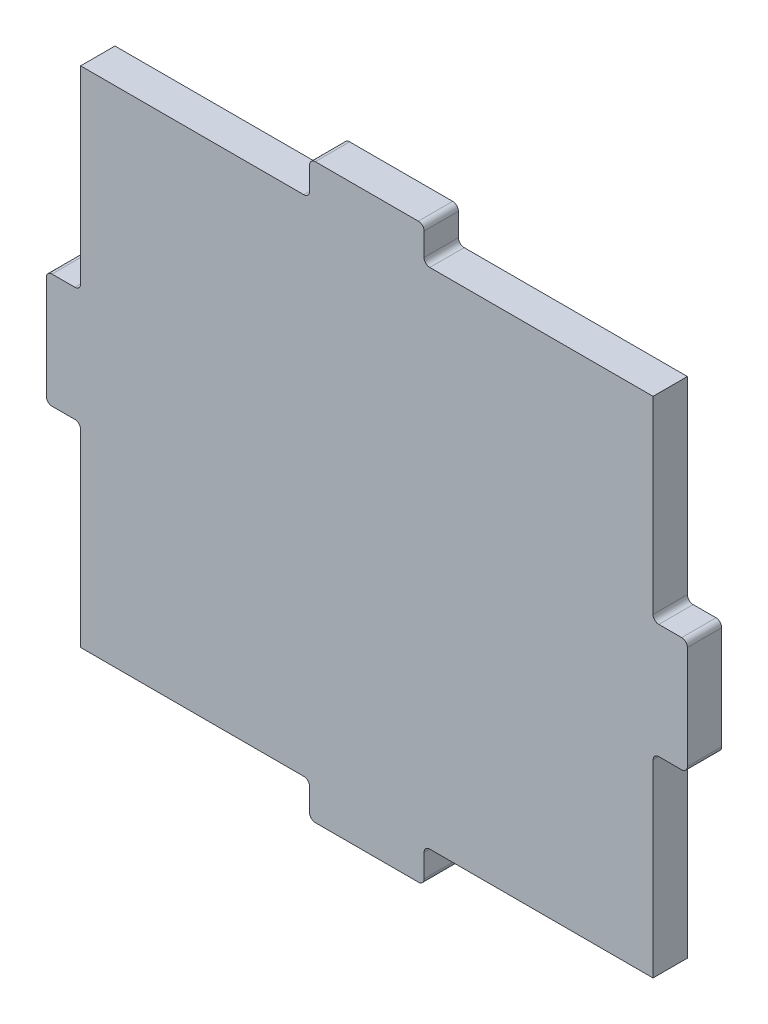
ISO-10303-21;
HEADER;
FILE_DESCRIPTION(('STEP AP214'),'2;1');
FILE_NAME('part.step','',(''),(''),'','','');
FILE_SCHEMA(('AUTOMOTIVE_DESIGN { 1 0 10303 214 1 1 1 1 }'));
ENDSEC;
DATA;
#1=APPLICATION_CONTEXT('core data for automotive mechanical design processes');
#2=APPLICATION_PROTOCOL_DEFINITION('international standard','automotive_design',2000,#1);
#3=PRODUCT_CONTEXT('',#1,'mechanical');
#4=PRODUCT('Part','Part','',(#3));
#5=PRODUCT_RELATED_PRODUCT_CATEGORY('part','',(#4));
#6=PRODUCT_DEFINITION_FORMATION('','',#4);
#7=PRODUCT_DEFINITION_CONTEXT('part definition',#1,'design');
#8=PRODUCT_DEFINITION('design','',#6,#7);
#9=PRODUCT_DEFINITION_SHAPE('','',#8);
#10=(LENGTH_UNIT() NAMED_UNIT(*) SI_UNIT(.MILLI.,.METRE.));
#11=(NAMED_UNIT(*) PLANE_ANGLE_UNIT() SI_UNIT($,.RADIAN.));
#12=(NAMED_UNIT(*) SI_UNIT($,.STERADIAN.) SOLID_ANGLE_UNIT());
#13=UNCERTAINTY_MEASURE_WITH_UNIT(LENGTH_MEASURE(1.E-05),#10,'distance_accuracy_value','');
#14=(GEOMETRIC_REPRESENTATION_CONTEXT(3) GLOBAL_UNCERTAINTY_ASSIGNED_CONTEXT((#13)) GLOBAL_UNIT_ASSIGNED_CONTEXT((#10,
#11,#12)) REPRESENTATION_CONTEXT('',''));
#15=CARTESIAN_POINT('',(0.,0.,0.));
#16=DIRECTION('',(0.,0.,1.));
#17=DIRECTION('',(1.,0.,0.));
#18=AXIS2_PLACEMENT_3D('',#15,#16,#17);
#19=CARTESIAN_POINT('',(50.,-10.,6.));
#20=DIRECTION('',(-1.,0.,0.));
#21=DIRECTION('',(0.,0.,1.));
#22=AXIS2_PLACEMENT_3D('',#19,#20,#21);
#23=PLANE('',#22);
#24=DIRECTION('',(0.,1.,0.));
#25=VECTOR('',#24,1.);
#26=CARTESIAN_POINT('',(50.,-10.,0.));
#27=LINE('',#26,#25);
#28=CARTESIAN_POINT('',(50.,-44.,0.));
#29=VERTEX_POINT('',#28);
#30=CARTESIAN_POINT('',(50.,-11.,0.));
#31=VERTEX_POINT('',#30);
#32=EDGE_CURVE('E366',#29,#31,#27,.T.);
#33=ORIENTED_EDGE('',*,*,#32,.T.);
#34=DIRECTION('',(0.,0.,-1.));
#35=VECTOR('',#34,1.);
#36=CARTESIAN_POINT('',(50.,-11.,6.));
#37=LINE('',#36,#35);
#38=CARTESIAN_POINT('',(50.,-11.,6.));
#39=VERTEX_POINT('',#38);
#40=EDGE_CURVE('E538',#31,#39,#37,.F.);
#41=ORIENTED_EDGE('',*,*,#40,.T.);
#42=DIRECTION('',(0.,1.,0.));
#43=VECTOR('',#42,1.);
#44=CARTESIAN_POINT('',(50.,-10.,6.));
#45=LINE('',#44,#43);
#46=CARTESIAN_POINT('',(50.,-44.,6.));
#47=VERTEX_POINT('',#46);
#48=EDGE_CURVE('E439',#47,#39,#45,.T.);
#49=ORIENTED_EDGE('',*,*,#48,.F.);
#50=DIRECTION('',(0.,0.,-1.));
#51=VECTOR('',#50,1.);
#52=CARTESIAN_POINT('',(50.,-44.,6.));
#53=LINE('',#52,#51);
#54=EDGE_CURVE('E365',#47,#29,#53,.T.);
#55=ORIENTED_EDGE('',*,*,#54,.T.);
#56=EDGE_LOOP('',(#33,#41,#49,#55));
#57=FACE_BOUND('',#56,.T.);
#58=ADVANCED_FACE('F45',(#57),#23,.F.);
#59=CARTESIAN_POINT('',(56.,-10.,6.));
#60=DIRECTION('',(0.,1.,0.));
#61=DIRECTION('',(-1.,0.,0.));
#62=AXIS2_PLACEMENT_3D('',#59,#60,#61);
#63=PLANE('',#62);
#64=DIRECTION('',(1.,0.,0.));
#65=VECTOR('',#64,1.);
#66=CARTESIAN_POINT('',(56.,-10.,0.));
#67=LINE('',#66,#65);
#68=CARTESIAN_POINT('',(51.,-10.,0.));
#69=VERTEX_POINT('',#68);
#70=CARTESIAN_POINT('',(55.,-10.,0.));
#71=VERTEX_POINT('',#70);
#72=EDGE_CURVE('E370',#69,#71,#67,.T.);
#73=ORIENTED_EDGE('',*,*,#72,.T.);
#74=DIRECTION('',(0.,0.,-1.));
#75=VECTOR('',#74,1.);
#76=CARTESIAN_POINT('',(55.,-10.,6.));
#77=LINE('',#76,#75);
#78=CARTESIAN_POINT('',(55.,-10.,6.));
#79=VERTEX_POINT('',#78);
#80=EDGE_CURVE('E535',#71,#79,#77,.F.);
#81=ORIENTED_EDGE('',*,*,#80,.T.);
#82=DIRECTION('',(1.,0.,0.));
#83=VECTOR('',#82,1.);
#84=CARTESIAN_POINT('',(56.,-10.,6.));
#85=LINE('',#84,#83);
#86=CARTESIAN_POINT('',(51.,-10.,6.));
#87=VERTEX_POINT('',#86);
#88=EDGE_CURVE('E746',#87,#79,#85,.T.);
#89=ORIENTED_EDGE('',*,*,#88,.F.);
#90=DIRECTION('',(0.,0.,-1.));
#91=VECTOR('',#90,1.);
#92=CARTESIAN_POINT('',(51.,-10.,0.));
#93=LINE('',#92,#91);
#94=EDGE_CURVE('E531',#87,#69,#93,.T.);
#95=ORIENTED_EDGE('',*,*,#94,.T.);
#96=EDGE_LOOP('',(#73,#81,#89,#95));
#97=FACE_BOUND('',#96,.T.);
#98=ADVANCED_FACE('F754',(#97),#63,.F.);
#99=CARTESIAN_POINT('',(56.,10.,6.));
#100=DIRECTION('',(-1.,0.,0.));
#101=DIRECTION('',(0.,-1.,0.));
#102=AXIS2_PLACEMENT_3D('',#99,#100,#101);
#103=PLANE('',#102);
#104=DIRECTION('',(0.,1.,0.));
#105=VECTOR('',#104,1.);
#106=CARTESIAN_POINT('',(56.,10.,6.));
#107=LINE('',#106,#105);
#108=CARTESIAN_POINT('',(56.,-9.00000000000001,6.));
#109=VERTEX_POINT('',#108);
#110=CARTESIAN_POINT('',(56.,9.,6.));
#111=VERTEX_POINT('',#110);
#112=EDGE_CURVE('E766',#109,#111,#107,.T.);
#113=ORIENTED_EDGE('',*,*,#112,.F.);
#114=DIRECTION('',(0.,0.,-1.));
#115=VECTOR('',#114,1.);
#116=CARTESIAN_POINT('',(56.,-9.00000000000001,6.));
#117=LINE('',#116,#115);
#118=CARTESIAN_POINT('',(56.,-9.00000000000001,0.));
#119=VERTEX_POINT('',#118);
#120=EDGE_CURVE('E527',#109,#119,#117,.T.);
#121=ORIENTED_EDGE('',*,*,#120,.T.);
#122=DIRECTION('',(0.,1.,0.));
#123=VECTOR('',#122,1.);
#124=CARTESIAN_POINT('',(56.,10.,0.));
#125=LINE('',#124,#123);
#126=CARTESIAN_POINT('',(56.,9.,0.));
#127=VERTEX_POINT('',#126);
#128=EDGE_CURVE('E374',#119,#127,#125,.T.);
#129=ORIENTED_EDGE('',*,*,#128,.T.);
#130=DIRECTION('',(0.,0.,-1.));
#131=VECTOR('',#130,1.);
#132=CARTESIAN_POINT('',(56.,9.,6.));
#133=LINE('',#132,#131);
#134=EDGE_CURVE('E524',#127,#111,#133,.F.);
#135=ORIENTED_EDGE('',*,*,#134,.T.);
#136=EDGE_LOOP('',(#113,#121,#129,#135));
#137=FACE_BOUND('',#136,.T.);
#138=ADVANCED_FACE('F763',(#137),#103,.F.);
#139=CARTESIAN_POINT('',(50.,10.,6.));
#140=DIRECTION('',(0.,-1.,0.));
#141=DIRECTION('',(1.,0.,0.));
#142=AXIS2_PLACEMENT_3D('',#139,#140,#141);
#143=PLANE('',#142);
#144=DIRECTION('',(-1.,0.,0.));
#145=VECTOR('',#144,1.);
#146=CARTESIAN_POINT('',(50.,10.,6.));
#147=LINE('',#146,#145);
#148=CARTESIAN_POINT('',(55.,10.,6.));
#149=VERTEX_POINT('',#148);
#150=CARTESIAN_POINT('',(51.,10.,6.));
#151=VERTEX_POINT('',#150);
#152=EDGE_CURVE('E293',#149,#151,#147,.T.);
#153=ORIENTED_EDGE('',*,*,#152,.F.);
#154=DIRECTION('',(0.,0.,-1.));
#155=VECTOR('',#154,1.);
#156=CARTESIAN_POINT('',(55.,10.,6.));
#157=LINE('',#156,#155);
#158=CARTESIAN_POINT('',(55.,10.,0.));
#159=VERTEX_POINT('',#158);
#160=EDGE_CURVE('E544',#149,#159,#157,.T.);
#161=ORIENTED_EDGE('',*,*,#160,.T.);
#162=DIRECTION('',(-1.,0.,0.));
#163=VECTOR('',#162,1.);
#164=CARTESIAN_POINT('',(50.,10.,0.));
#165=LINE('',#164,#163);
#166=CARTESIAN_POINT('',(51.,10.,0.));
#167=VERTEX_POINT('',#166);
#168=EDGE_CURVE('E378',#159,#167,#165,.T.);
#169=ORIENTED_EDGE('',*,*,#168,.T.);
#170=DIRECTION('',(0.,0.,-1.));
#171=VECTOR('',#170,1.);
#172=CARTESIAN_POINT('',(51.,10.,6.));
#173=LINE('',#172,#171);
#174=EDGE_CURVE('E541',#167,#151,#173,.F.);
#175=ORIENTED_EDGE('',*,*,#174,.T.);
#176=EDGE_LOOP('',(#153,#161,#169,#175));
#177=FACE_BOUND('',#176,.T.);
#178=ADVANCED_FACE('F1049',(#177),#143,.F.);
#179=CARTESIAN_POINT('',(50.,44.,6.));
#180=DIRECTION('',(-1.,0.,0.));
#181=DIRECTION('',(0.,0.,1.));
#182=AXIS2_PLACEMENT_3D('',#179,#180,#181);
#183=PLANE('',#182);
#184=DIRECTION('',(0.,1.,0.));
#185=VECTOR('',#184,1.);
#186=CARTESIAN_POINT('',(50.,44.,6.));
#187=LINE('',#186,#185);
#188=CARTESIAN_POINT('',(50.,11.,6.));
#189=VERTEX_POINT('',#188);
#190=CARTESIAN_POINT('',(50.,44.,6.));
#191=VERTEX_POINT('',#190);
#192=EDGE_CURVE('E279',#189,#191,#187,.T.);
#193=ORIENTED_EDGE('',*,*,#192,.F.);
#194=DIRECTION('',(0.,0.,-1.));
#195=VECTOR('',#194,1.);
#196=CARTESIAN_POINT('',(50.,11.,0.));
#197=LINE('',#196,#195);
#198=CARTESIAN_POINT('',(50.,11.,0.));
#199=VERTEX_POINT('',#198);
#200=EDGE_CURVE('E548',#189,#199,#197,.T.);
#201=ORIENTED_EDGE('',*,*,#200,.T.);
#202=DIRECTION('',(0.,1.,0.));
#203=VECTOR('',#202,1.);
#204=CARTESIAN_POINT('',(50.,44.,0.));
#205=LINE('',#204,#203);
#206=CARTESIAN_POINT('',(50.,44.,0.));
#207=VERTEX_POINT('',#206);
#208=EDGE_CURVE('E299',#199,#207,#205,.T.);
#209=ORIENTED_EDGE('',*,*,#208,.T.);
#210=DIRECTION('',(0.,0.,-1.));
#211=VECTOR('',#210,1.);
#212=CARTESIAN_POINT('',(50.,44.,6.));
#213=LINE('',#212,#211);
#214=EDGE_CURVE('E296',#191,#207,#213,.T.);
#215=ORIENTED_EDGE('',*,*,#214,.F.);
#216=EDGE_LOOP('',(#193,#201,#209,#215));
#217=FACE_BOUND('',#216,.T.);
#218=ADVANCED_FACE('F297',(#217),#183,.F.);
#219=CARTESIAN_POINT('',(10.,44.,6.));
#220=DIRECTION('',(0.,-1.,0.));
#221=DIRECTION('',(1.,0.,0.));
#222=AXIS2_PLACEMENT_3D('',#219,#220,#221);
#223=PLANE('',#222);
#224=DIRECTION('',(-1.,0.,0.));
#225=VECTOR('',#224,1.);
#226=CARTESIAN_POINT('',(10.,44.,0.));
#227=LINE('',#226,#225);
#228=CARTESIAN_POINT('',(11.,44.,0.));
#229=VERTEX_POINT('',#228);
#230=EDGE_CURVE('E384',#207,#229,#227,.T.);
#231=ORIENTED_EDGE('',*,*,#230,.T.);
#232=DIRECTION('',(0.,0.,-1.));
#233=VECTOR('',#232,1.);
#234=CARTESIAN_POINT('',(11.,44.,6.));
#235=LINE('',#234,#233);
#236=CARTESIAN_POINT('',(11.,44.,6.));
#237=VERTEX_POINT('',#236);
#238=EDGE_CURVE('E309',#229,#237,#235,.F.);
#239=ORIENTED_EDGE('',*,*,#238,.T.);
#240=DIRECTION('',(-1.,0.,0.));
#241=VECTOR('',#240,1.);
#242=CARTESIAN_POINT('',(10.,44.,6.));
#243=LINE('',#242,#241);
#244=EDGE_CURVE('E284',#191,#237,#243,.T.);
#245=ORIENTED_EDGE('',*,*,#244,.F.);
#246=ORIENTED_EDGE('',*,*,#214,.T.);
#247=EDGE_LOOP('',(#231,#239,#245,#246));
#248=FACE_BOUND('',#247,.T.);
#249=ADVANCED_FACE('F307',(#248),#223,.F.);
#250=CARTESIAN_POINT('',(10.,50.,6.));
#251=DIRECTION('',(-1.,0.,0.));
#252=DIRECTION('',(0.,-1.,0.));
#253=AXIS2_PLACEMENT_3D('',#250,#251,#252);
#254=PLANE('',#253);
#255=DIRECTION('',(0.,1.,0.));
#256=VECTOR('',#255,1.);
#257=CARTESIAN_POINT('',(10.,50.,6.));
#258=LINE('',#257,#256);
#259=CARTESIAN_POINT('',(10.,45.,6.));
#260=VERTEX_POINT('',#259);
#261=CARTESIAN_POINT('',(10.,49.,6.));
#262=VERTEX_POINT('',#261);
#263=EDGE_CURVE('E311',#260,#262,#258,.T.);
#264=ORIENTED_EDGE('',*,*,#263,.F.);
#265=DIRECTION('',(0.,0.,-1.));
#266=VECTOR('',#265,1.);
#267=CARTESIAN_POINT('',(10.,45.,0.));
#268=LINE('',#267,#266);
#269=CARTESIAN_POINT('',(10.,45.,0.));
#270=VERTEX_POINT('',#269);
#271=EDGE_CURVE('E554',#260,#270,#268,.T.);
#272=ORIENTED_EDGE('',*,*,#271,.T.);
#273=DIRECTION('',(0.,1.,0.));
#274=VECTOR('',#273,1.);
#275=CARTESIAN_POINT('',(10.,50.,0.));
#276=LINE('',#275,#274);
#277=CARTESIAN_POINT('',(10.,49.,0.));
#278=VERTEX_POINT('',#277);
#279=EDGE_CURVE('E387',#270,#278,#276,.T.);
#280=ORIENTED_EDGE('',*,*,#279,.T.);
#281=DIRECTION('',(0.,0.,-1.));
#282=VECTOR('',#281,1.);
#283=CARTESIAN_POINT('',(10.,49.,6.));
#284=LINE('',#283,#282);
#285=EDGE_CURVE('E551',#278,#262,#284,.F.);
#286=ORIENTED_EDGE('',*,*,#285,.T.);
#287=EDGE_LOOP('',(#264,#272,#280,#286));
#288=FACE_BOUND('',#287,.T.);
#289=ADVANCED_FACE('F787',(#288),#254,.F.);
#290=CARTESIAN_POINT('',(-10.,50.,6.));
#291=DIRECTION('',(0.,-1.,0.));
#292=DIRECTION('',(0.,0.,-1.));
#293=AXIS2_PLACEMENT_3D('',#290,#291,#292);
#294=PLANE('',#293);
#295=DIRECTION('',(-1.,0.,0.));
#296=VECTOR('',#295,1.);
#297=CARTESIAN_POINT('',(-10.,50.,6.));
#298=LINE('',#297,#296);
#299=CARTESIAN_POINT('',(9.00000000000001,50.,6.));
#300=VERTEX_POINT('',#299);
#301=CARTESIAN_POINT('',(-9.,50.,6.));
#302=VERTEX_POINT('',#301);
#303=EDGE_CURVE('E315',#300,#302,#298,.T.);
#304=ORIENTED_EDGE('',*,*,#303,.F.);
#305=DIRECTION('',(0.,0.,-1.));
#306=VECTOR('',#305,1.);
#307=CARTESIAN_POINT('',(9.00000000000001,50.,6.));
#308=LINE('',#307,#306);
#309=CARTESIAN_POINT('',(9.00000000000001,50.,0.));
#310=VERTEX_POINT('',#309);
#311=EDGE_CURVE('E563',#300,#310,#308,.T.);
#312=ORIENTED_EDGE('',*,*,#311,.T.);
#313=DIRECTION('',(-1.,0.,0.));
#314=VECTOR('',#313,1.);
#315=CARTESIAN_POINT('',(-10.,50.,0.));
#316=LINE('',#315,#314);
#317=CARTESIAN_POINT('',(-9.,50.,0.));
#318=VERTEX_POINT('',#317);
#319=EDGE_CURVE('E391',#310,#318,#316,.T.);
#320=ORIENTED_EDGE('',*,*,#319,.T.);
#321=DIRECTION('',(0.,0.,-1.));
#322=VECTOR('',#321,1.);
#323=CARTESIAN_POINT('',(-9.,50.,6.));
#324=LINE('',#323,#322);
#325=EDGE_CURVE('E560',#318,#302,#324,.F.);
#326=ORIENTED_EDGE('',*,*,#325,.T.);
#327=EDGE_LOOP('',(#304,#312,#320,#326));
#328=FACE_BOUND('',#327,.T.);
#329=ADVANCED_FACE('F795',(#328),#294,.F.);
#330=CARTESIAN_POINT('',(-10.,44.,6.));
#331=DIRECTION('',(1.,0.,0.));
#332=DIRECTION('',(0.,1.,0.));
#333=AXIS2_PLACEMENT_3D('',#330,#331,#332);
#334=PLANE('',#333);
#335=DIRECTION('',(0.,-1.,0.));
#336=VECTOR('',#335,1.);
#337=CARTESIAN_POINT('',(-10.,44.,6.));
#338=LINE('',#337,#336);
#339=CARTESIAN_POINT('',(-10.,49.,6.));
#340=VERTEX_POINT('',#339);
#341=CARTESIAN_POINT('',(-10.,45.,6.));
#342=VERTEX_POINT('',#341);
#343=EDGE_CURVE('E322',#340,#342,#338,.T.);
#344=ORIENTED_EDGE('',*,*,#343,.F.);
#345=DIRECTION('',(0.,0.,-1.));
#346=VECTOR('',#345,1.);
#347=CARTESIAN_POINT('',(-10.,49.,6.));
#348=LINE('',#347,#346);
#349=CARTESIAN_POINT('',(-10.,49.,0.));
#350=VERTEX_POINT('',#349);
#351=EDGE_CURVE('E598',#340,#350,#348,.T.);
#352=ORIENTED_EDGE('',*,*,#351,.T.);
#353=DIRECTION('',(0.,-1.,0.));
#354=VECTOR('',#353,1.);
#355=CARTESIAN_POINT('',(-10.,44.,0.));
#356=LINE('',#355,#354);
#357=CARTESIAN_POINT('',(-10.,45.,0.));
#358=VERTEX_POINT('',#357);
#359=EDGE_CURVE('E395',#350,#358,#356,.T.);
#360=ORIENTED_EDGE('',*,*,#359,.T.);
#361=DIRECTION('',(0.,0.,-1.));
#362=VECTOR('',#361,1.);
#363=CARTESIAN_POINT('',(-10.,45.,6.));
#364=LINE('',#363,#362);
#365=EDGE_CURVE('E595',#358,#342,#364,.F.);
#366=ORIENTED_EDGE('',*,*,#365,.T.);
#367=EDGE_LOOP('',(#344,#352,#360,#366));
#368=FACE_BOUND('',#367,.T.);
#369=ADVANCED_FACE('F657',(#368),#334,.F.);
#370=CARTESIAN_POINT('',(-50.,44.,6.));
#371=DIRECTION('',(0.,-1.,0.));
#372=DIRECTION('',(1.,0.,0.));
#373=AXIS2_PLACEMENT_3D('',#370,#371,#372);
#374=PLANE('',#373);
#375=DIRECTION('',(-1.,0.,0.));
#376=VECTOR('',#375,1.);
#377=CARTESIAN_POINT('',(-50.,44.,6.));
#378=LINE('',#377,#376);
#379=CARTESIAN_POINT('',(-11.,44.,6.));
#380=VERTEX_POINT('',#379);
#381=CARTESIAN_POINT('',(-50.,44.,6.));
#382=VERTEX_POINT('',#381);
#383=EDGE_CURVE('E326',#380,#382,#378,.T.);
#384=ORIENTED_EDGE('',*,*,#383,.F.);
#385=DIRECTION('',(0.,0.,-1.));
#386=VECTOR('',#385,1.);
#387=CARTESIAN_POINT('',(-11.,44.,0.));
#388=LINE('',#387,#386);
#389=CARTESIAN_POINT('',(-11.,44.,0.));
#390=VERTEX_POINT('',#389);
#391=EDGE_CURVE('E602',#380,#390,#388,.T.);
#392=ORIENTED_EDGE('',*,*,#391,.T.);
#393=DIRECTION('',(-1.,0.,0.));
#394=VECTOR('',#393,1.);
#395=CARTESIAN_POINT('',(-50.,44.,0.));
#396=LINE('',#395,#394);
#397=CARTESIAN_POINT('',(-50.,44.,0.));
#398=VERTEX_POINT('',#397);
#399=EDGE_CURVE('E399',#390,#398,#396,.T.);
#400=ORIENTED_EDGE('',*,*,#399,.T.);
#401=DIRECTION('',(0.,0.,-1.));
#402=VECTOR('',#401,1.);
#403=CARTESIAN_POINT('',(-50.,44.,6.));
#404=LINE('',#403,#402);
#405=EDGE_CURVE('E305',#382,#398,#404,.T.);
#406=ORIENTED_EDGE('',*,*,#405,.F.);
#407=EDGE_LOOP('',(#384,#392,#400,#406));
#408=FACE_BOUND('',#407,.T.);
#409=ADVANCED_FACE('F663',(#408),#374,.F.);
#410=CARTESIAN_POINT('',(-50.,44.,6.));
#411=DIRECTION('',(1.,0.,0.));
#412=DIRECTION('',(0.,1.,0.));
#413=AXIS2_PLACEMENT_3D('',#410,#411,#412);
#414=PLANE('',#413);
#415=DIRECTION('',(0.,-1.,0.));
#416=VECTOR('',#415,1.);
#417=CARTESIAN_POINT('',(-50.,44.,0.));
#418=LINE('',#417,#416);
#419=CARTESIAN_POINT('',(-50.,11.,0.));
#420=VERTEX_POINT('',#419);
#421=EDGE_CURVE('E402',#398,#420,#418,.T.);
#422=ORIENTED_EDGE('',*,*,#421,.T.);
#423=DIRECTION('',(0.,0.,-1.));
#424=VECTOR('',#423,1.);
#425=CARTESIAN_POINT('',(-50.,11.,6.));
#426=LINE('',#425,#424);
#427=CARTESIAN_POINT('',(-50.,11.,6.));
#428=VERTEX_POINT('',#427);
#429=EDGE_CURVE('E592',#420,#428,#426,.F.);
#430=ORIENTED_EDGE('',*,*,#429,.T.);
#431=DIRECTION('',(0.,-1.,0.));
#432=VECTOR('',#431,1.);
#433=CARTESIAN_POINT('',(-50.,44.,6.));
#434=LINE('',#433,#432);
#435=EDGE_CURVE('E329',#382,#428,#434,.T.);
#436=ORIENTED_EDGE('',*,*,#435,.F.);
#437=ORIENTED_EDGE('',*,*,#405,.T.);
#438=EDGE_LOOP('',(#422,#430,#436,#437));
#439=FACE_BOUND('',#438,.T.);
#440=ADVANCED_FACE('F666',(#439),#414,.F.);
#441=CARTESIAN_POINT('',(-50.,10.,6.));
#442=DIRECTION('',(0.,-1.,0.));
#443=DIRECTION('',(1.,0.,0.));
#444=AXIS2_PLACEMENT_3D('',#441,#442,#443);
#445=PLANE('',#444);
#446=DIRECTION('',(-1.,0.,0.));
#447=VECTOR('',#446,1.);
#448=CARTESIAN_POINT('',(-50.,10.,0.));
#449=LINE('',#448,#447);
#450=CARTESIAN_POINT('',(-51.,10.,0.));
#451=VERTEX_POINT('',#450);
#452=CARTESIAN_POINT('',(-55.,10.,0.));
#453=VERTEX_POINT('',#452);
#454=EDGE_CURVE('E406',#451,#453,#449,.T.);
#455=ORIENTED_EDGE('',*,*,#454,.T.);
#456=DIRECTION('',(0.,0.,-1.));
#457=VECTOR('',#456,1.);
#458=CARTESIAN_POINT('',(-55.,10.,6.));
#459=LINE('',#458,#457);
#460=CARTESIAN_POINT('',(-55.,10.,6.));
#461=VERTEX_POINT('',#460);
#462=EDGE_CURVE('E589',#453,#461,#459,.F.);
#463=ORIENTED_EDGE('',*,*,#462,.T.);
#464=DIRECTION('',(-1.,0.,0.));
#465=VECTOR('',#464,1.);
#466=CARTESIAN_POINT('',(-50.,10.,6.));
#467=LINE('',#466,#465);
#468=CARTESIAN_POINT('',(-51.,10.,6.));
#469=VERTEX_POINT('',#468);
#470=EDGE_CURVE('E333',#469,#461,#467,.T.);
#471=ORIENTED_EDGE('',*,*,#470,.F.);
#472=DIRECTION('',(0.,0.,-1.));
#473=VECTOR('',#472,1.);
#474=CARTESIAN_POINT('',(-51.,10.,0.));
#475=LINE('',#474,#473);
#476=EDGE_CURVE('E585',#469,#451,#475,.T.);
#477=ORIENTED_EDGE('',*,*,#476,.T.);
#478=EDGE_LOOP('',(#455,#463,#471,#477));
#479=FACE_BOUND('',#478,.T.);
#480=ADVANCED_FACE('F675',(#479),#445,.F.);
#481=CARTESIAN_POINT('',(-56.,10.,6.));
#482=DIRECTION('',(1.,0.,0.));
#483=DIRECTION('',(0.,1.,0.));
#484=AXIS2_PLACEMENT_3D('',#481,#482,#483);
#485=PLANE('',#484);
#486=DIRECTION('',(0.,-1.,0.));
#487=VECTOR('',#486,1.);
#488=CARTESIAN_POINT('',(-56.,10.,0.));
#489=LINE('',#488,#487);
#490=CARTESIAN_POINT('',(-56.,9.,0.));
#491=VERTEX_POINT('',#490);
#492=CARTESIAN_POINT('',(-56.,-9.,0.));
#493=VERTEX_POINT('',#492);
#494=EDGE_CURVE('E410',#491,#493,#489,.T.);
#495=ORIENTED_EDGE('',*,*,#494,.T.);
#496=DIRECTION('',(0.,0.,-1.));
#497=VECTOR('',#496,1.);
#498=CARTESIAN_POINT('',(-56.,-9.,6.));
#499=LINE('',#498,#497);
#500=CARTESIAN_POINT('',(-56.,-9.,6.));
#501=VERTEX_POINT('',#500);
#502=EDGE_CURVE('E582',#493,#501,#499,.F.);
#503=ORIENTED_EDGE('',*,*,#502,.T.);
#504=DIRECTION('',(0.,-1.,0.));
#505=VECTOR('',#504,1.);
#506=CARTESIAN_POINT('',(-56.,10.,6.));
#507=LINE('',#506,#505);
#508=CARTESIAN_POINT('',(-56.,9.,6.));
#509=VERTEX_POINT('',#508);
#510=EDGE_CURVE('E337',#509,#501,#507,.T.);
#511=ORIENTED_EDGE('',*,*,#510,.F.);
#512=DIRECTION('',(0.,0.,-1.));
#513=VECTOR('',#512,1.);
#514=CARTESIAN_POINT('',(-56.,9.,6.));
#515=LINE('',#514,#513);
#516=EDGE_CURVE('E578',#509,#491,#515,.T.);
#517=ORIENTED_EDGE('',*,*,#516,.T.);
#518=EDGE_LOOP('',(#495,#503,#511,#517));
#519=FACE_BOUND('',#518,.T.);
#520=ADVANCED_FACE('F684',(#519),#485,.F.);
#521=CARTESIAN_POINT('',(-56.,-10.,6.));
#522=DIRECTION('',(0.,1.,0.));
#523=DIRECTION('',(-1.,0.,0.));
#524=AXIS2_PLACEMENT_3D('',#521,#522,#523);
#525=PLANE('',#524);
#526=DIRECTION('',(1.,0.,0.));
#527=VECTOR('',#526,1.);
#528=CARTESIAN_POINT('',(-56.,-10.,0.));
#529=LINE('',#528,#527);
#530=CARTESIAN_POINT('',(-55.,-10.,0.));
#531=VERTEX_POINT('',#530);
#532=CARTESIAN_POINT('',(-51.,-10.,0.));
#533=VERTEX_POINT('',#532);
#534=EDGE_CURVE('E414',#531,#533,#529,.T.);
#535=ORIENTED_EDGE('',*,*,#534,.T.);
#536=DIRECTION('',(0.,0.,-1.));
#537=VECTOR('',#536,1.);
#538=CARTESIAN_POINT('',(-51.,-10.,6.));
#539=LINE('',#538,#537);
#540=CARTESIAN_POINT('',(-51.,-10.,6.));
#541=VERTEX_POINT('',#540);
#542=EDGE_CURVE('E575',#533,#541,#539,.F.);
#543=ORIENTED_EDGE('',*,*,#542,.T.);
#544=DIRECTION('',(1.,0.,0.));
#545=VECTOR('',#544,1.);
#546=CARTESIAN_POINT('',(-56.,-10.,6.));
#547=LINE('',#546,#545);
#548=CARTESIAN_POINT('',(-55.,-10.,6.));
#549=VERTEX_POINT('',#548);
#550=EDGE_CURVE('E341',#549,#541,#547,.T.);
#551=ORIENTED_EDGE('',*,*,#550,.F.);
#552=DIRECTION('',(0.,0.,-1.));
#553=VECTOR('',#552,1.);
#554=CARTESIAN_POINT('',(-55.,-10.,6.));
#555=LINE('',#554,#553);
#556=EDGE_CURVE('E571',#549,#531,#555,.T.);
#557=ORIENTED_EDGE('',*,*,#556,.T.);
#558=EDGE_LOOP('',(#535,#543,#551,#557));
#559=FACE_BOUND('',#558,.T.);
#560=ADVANCED_FACE('F693',(#559),#525,.F.);
#561=CARTESIAN_POINT('',(-50.,-10.,6.));
#562=DIRECTION('',(1.,0.,0.));
#563=DIRECTION('',(0.,1.,0.));
#564=AXIS2_PLACEMENT_3D('',#561,#562,#563);
#565=PLANE('',#564);
#566=DIRECTION('',(0.,-1.,0.));
#567=VECTOR('',#566,1.);
#568=CARTESIAN_POINT('',(-50.,-10.,6.));
#569=LINE('',#568,#567);
#570=CARTESIAN_POINT('',(-50.,-11.,6.));
#571=VERTEX_POINT('',#570);
#572=CARTESIAN_POINT('',(-50.,-44.,6.));
#573=VERTEX_POINT('',#572);
#574=EDGE_CURVE('E345',#571,#573,#569,.T.);
#575=ORIENTED_EDGE('',*,*,#574,.F.);
#576=DIRECTION('',(0.,0.,-1.));
#577=VECTOR('',#576,1.);
#578=CARTESIAN_POINT('',(-50.,-11.,0.));
#579=LINE('',#578,#577);
#580=CARTESIAN_POINT('',(-50.,-11.,0.));
#581=VERTEX_POINT('',#580);
#582=EDGE_CURVE('E567',#571,#581,#579,.T.);
#583=ORIENTED_EDGE('',*,*,#582,.T.);
#584=DIRECTION('',(0.,-1.,0.));
#585=VECTOR('',#584,1.);
#586=CARTESIAN_POINT('',(-50.,-10.,0.));
#587=LINE('',#586,#585);
#588=CARTESIAN_POINT('',(-50.,-44.,0.));
#589=VERTEX_POINT('',#588);
#590=EDGE_CURVE('E418',#581,#589,#587,.T.);
#591=ORIENTED_EDGE('',*,*,#590,.T.);
#592=DIRECTION('',(0.,0.,-1.));
#593=VECTOR('',#592,1.);
#594=CARTESIAN_POINT('',(-50.,-44.,6.));
#595=LINE('',#594,#593);
#596=EDGE_CURVE('E443',#573,#589,#595,.T.);
#597=ORIENTED_EDGE('',*,*,#596,.F.);
#598=EDGE_LOOP('',(#575,#583,#591,#597));
#599=FACE_BOUND('',#598,.T.);
#600=ADVANCED_FACE('F703',(#599),#565,.F.);
#601=CARTESIAN_POINT('',(-50.,-44.,6.));
#602=DIRECTION('',(0.,1.,0.));
#603=DIRECTION('',(-1.,0.,0.));
#604=AXIS2_PLACEMENT_3D('',#601,#602,#603);
#605=PLANE('',#604);
#606=DIRECTION('',(1.,0.,0.));
#607=VECTOR('',#606,1.);
#608=CARTESIAN_POINT('',(-50.,-44.,0.));
#609=LINE('',#608,#607);
#610=CARTESIAN_POINT('',(-11.,-44.,0.));
#611=VERTEX_POINT('',#610);
#612=EDGE_CURVE('E421',#589,#611,#609,.T.);
#613=ORIENTED_EDGE('',*,*,#612,.T.);
#614=DIRECTION('',(0.,0.,-1.));
#615=VECTOR('',#614,1.);
#616=CARTESIAN_POINT('',(-11.,-44.,6.));
#617=LINE('',#616,#615);
#618=CARTESIAN_POINT('',(-11.,-44.,6.));
#619=VERTEX_POINT('',#618);
#620=EDGE_CURVE('E511',#611,#619,#617,.F.);
#621=ORIENTED_EDGE('',*,*,#620,.T.);
#622=DIRECTION('',(1.,0.,0.));
#623=VECTOR('',#622,1.);
#624=CARTESIAN_POINT('',(-50.,-44.,6.));
#625=LINE('',#624,#623);
#626=EDGE_CURVE('E348',#573,#619,#625,.T.);
#627=ORIENTED_EDGE('',*,*,#626,.F.);
#628=ORIENTED_EDGE('',*,*,#596,.T.);
#629=EDGE_LOOP('',(#613,#621,#627,#628));
#630=FACE_BOUND('',#629,.T.);
#631=ADVANCED_FACE('F964',(#630),#605,.F.);
#632=CARTESIAN_POINT('',(-10.,-44.,6.));
#633=DIRECTION('',(1.,0.,0.));
#634=DIRECTION('',(0.,1.,0.));
#635=AXIS2_PLACEMENT_3D('',#632,#633,#634);
#636=PLANE('',#635);
#637=DIRECTION('',(0.,-1.,0.));
#638=VECTOR('',#637,1.);
#639=CARTESIAN_POINT('',(-10.,-44.,0.));
#640=LINE('',#639,#638);
#641=CARTESIAN_POINT('',(-10.,-45.,0.));
#642=VERTEX_POINT('',#641);
#643=CARTESIAN_POINT('',(-10.,-49.,0.));
#644=VERTEX_POINT('',#643);
#645=EDGE_CURVE('E425',#642,#644,#640,.T.);
#646=ORIENTED_EDGE('',*,*,#645,.T.);
#647=DIRECTION('',(0.,0.,-1.));
#648=VECTOR('',#647,1.);
#649=CARTESIAN_POINT('',(-10.,-49.,6.));
#650=LINE('',#649,#648);
#651=CARTESIAN_POINT('',(-10.,-49.,6.));
#652=VERTEX_POINT('',#651);
#653=EDGE_CURVE('E484',#644,#652,#650,.F.);
#654=ORIENTED_EDGE('',*,*,#653,.T.);
#655=DIRECTION('',(0.,-1.,0.));
#656=VECTOR('',#655,1.);
#657=CARTESIAN_POINT('',(-10.,-44.,6.));
#658=LINE('',#657,#656);
#659=CARTESIAN_POINT('',(-10.,-45.,6.));
#660=VERTEX_POINT('',#659);
#661=EDGE_CURVE('E352',#660,#652,#658,.T.);
#662=ORIENTED_EDGE('',*,*,#661,.F.);
#663=DIRECTION('',(0.,0.,-1.));
#664=VECTOR('',#663,1.);
#665=CARTESIAN_POINT('',(-10.,-45.,0.));
#666=LINE('',#665,#664);
#667=EDGE_CURVE('E480',#660,#642,#666,.T.);
#668=ORIENTED_EDGE('',*,*,#667,.T.);
#669=EDGE_LOOP('',(#646,#654,#662,#668));
#670=FACE_BOUND('',#669,.T.);
#671=ADVANCED_FACE('F715',(#670),#636,.F.);
#672=CARTESIAN_POINT('',(-10.,-50.,6.));
#673=DIRECTION('',(0.,1.,0.));
#674=DIRECTION('',(0.,0.,1.));
#675=AXIS2_PLACEMENT_3D('',#672,#673,#674);
#676=PLANE('',#675);
#677=DIRECTION('',(1.,0.,0.));
#678=VECTOR('',#677,1.);
#679=CARTESIAN_POINT('',(-10.,-50.,6.));
#680=LINE('',#679,#678);
#681=CARTESIAN_POINT('',(-9.,-50.,6.));
#682=VERTEX_POINT('',#681);
#683=CARTESIAN_POINT('',(9.,-50.,6.));
#684=VERTEX_POINT('',#683);
#685=EDGE_CURVE('E355',#682,#684,#680,.T.);
#686=ORIENTED_EDGE('',*,*,#685,.F.);
#687=DIRECTION('',(0.,0.,-1.));
#688=VECTOR('',#687,1.);
#689=CARTESIAN_POINT('',(-9.,-50.,6.));
#690=LINE('',#689,#688);
#691=CARTESIAN_POINT('',(-9.,-50.,0.));
#692=VERTEX_POINT('',#691);
#693=EDGE_CURVE('E452',#682,#692,#690,.T.);
#694=ORIENTED_EDGE('',*,*,#693,.T.);
#695=DIRECTION('',(1.,0.,0.));
#696=VECTOR('',#695,1.);
#697=CARTESIAN_POINT('',(-10.,-50.,0.));
#698=LINE('',#697,#696);
#699=CARTESIAN_POINT('',(9.,-50.,0.));
#700=VERTEX_POINT('',#699);
#701=EDGE_CURVE('E429',#692,#700,#698,.T.);
#702=ORIENTED_EDGE('',*,*,#701,.T.);
#703=DIRECTION('',(0.,0.,-1.));
#704=VECTOR('',#703,1.);
#705=CARTESIAN_POINT('',(9.,-50.,6.));
#706=LINE('',#705,#704);
#707=EDGE_CURVE('E304',#700,#684,#706,.F.);
#708=ORIENTED_EDGE('',*,*,#707,.T.);
#709=EDGE_LOOP('',(#686,#694,#702,#708));
#710=FACE_BOUND('',#709,.T.);
#711=ADVANCED_FACE('F723',(#710),#676,.F.);
#712=CARTESIAN_POINT('',(10.,-50.,6.));
#713=DIRECTION('',(-1.,0.,0.));
#714=DIRECTION('',(0.,-1.,0.));
#715=AXIS2_PLACEMENT_3D('',#712,#713,#714);
#716=PLANE('',#715);
#717=DIRECTION('',(0.,1.,0.));
#718=VECTOR('',#717,1.);
#719=CARTESIAN_POINT('',(10.,-50.,6.));
#720=LINE('',#719,#718);
#721=CARTESIAN_POINT('',(10.,-49.,6.));
#722=VERTEX_POINT('',#721);
#723=CARTESIAN_POINT('',(10.,-45.,6.));
#724=VERTEX_POINT('',#723);
#725=EDGE_CURVE('E359',#722,#724,#720,.T.);
#726=ORIENTED_EDGE('',*,*,#725,.F.);
#727=DIRECTION('',(0.,0.,-1.));
#728=VECTOR('',#727,1.);
#729=CARTESIAN_POINT('',(10.,-49.,6.));
#730=LINE('',#729,#728);
#731=CARTESIAN_POINT('',(10.,-49.,0.));
#732=VERTEX_POINT('',#731);
#733=EDGE_CURVE('E516',#722,#732,#730,.T.);
#734=ORIENTED_EDGE('',*,*,#733,.T.);
#735=DIRECTION('',(0.,1.,0.));
#736=VECTOR('',#735,1.);
#737=CARTESIAN_POINT('',(10.,-50.,0.));
#738=LINE('',#737,#736);
#739=CARTESIAN_POINT('',(10.,-45.,0.));
#740=VERTEX_POINT('',#739);
#741=EDGE_CURVE('E433',#732,#740,#738,.T.);
#742=ORIENTED_EDGE('',*,*,#741,.T.);
#743=DIRECTION('',(0.,0.,-1.));
#744=VECTOR('',#743,1.);
#745=CARTESIAN_POINT('',(10.,-45.,6.));
#746=LINE('',#745,#744);
#747=EDGE_CURVE('E69',#740,#724,#746,.F.);
#748=ORIENTED_EDGE('',*,*,#747,.T.);
#749=EDGE_LOOP('',(#726,#734,#742,#748));
#750=FACE_BOUND('',#749,.T.);
#751=ADVANCED_FACE('F730',(#750),#716,.F.);
#752=CARTESIAN_POINT('',(10.,-44.,6.));
#753=DIRECTION('',(0.,1.,0.));
#754=DIRECTION('',(-1.,0.,0.));
#755=AXIS2_PLACEMENT_3D('',#752,#753,#754);
#756=PLANE('',#755);
#757=DIRECTION('',(1.,0.,0.));
#758=VECTOR('',#757,1.);
#759=CARTESIAN_POINT('',(10.,-44.,6.));
#760=LINE('',#759,#758);
#761=CARTESIAN_POINT('',(11.,-44.,6.));
#762=VERTEX_POINT('',#761);
#763=EDGE_CURVE('E362',#762,#47,#760,.T.);
#764=ORIENTED_EDGE('',*,*,#763,.F.);
#765=DIRECTION('',(0.,0.,-1.));
#766=VECTOR('',#765,1.);
#767=CARTESIAN_POINT('',(11.,-44.,0.));
#768=LINE('',#767,#766);
#769=CARTESIAN_POINT('',(11.,-44.,0.));
#770=VERTEX_POINT('',#769);
#771=EDGE_CURVE('E520',#762,#770,#768,.T.);
#772=ORIENTED_EDGE('',*,*,#771,.T.);
#773=DIRECTION('',(1.,0.,0.));
#774=VECTOR('',#773,1.);
#775=CARTESIAN_POINT('',(10.,-44.,0.));
#776=LINE('',#775,#774);
#777=EDGE_CURVE('E436',#770,#29,#776,.T.);
#778=ORIENTED_EDGE('',*,*,#777,.T.);
#779=ORIENTED_EDGE('',*,*,#54,.F.);
#780=EDGE_LOOP('',(#764,#772,#778,#779));
#781=FACE_BOUND('',#780,.T.);
#782=ADVANCED_FACE('F737',(#781),#756,.F.);
#783=CARTESIAN_POINT('',(0.,0.,6.));
#784=DIRECTION('',(0.,0.,1.));
#785=DIRECTION('',(1.,0.,0.));
#786=AXIS2_PLACEMENT_3D('',#783,#784,#785);
#787=PLANE('',#786);
#788=ORIENTED_EDGE('',*,*,#661,.T.);
#789=CARTESIAN_POINT('',(-9.,-49.,6.));
#790=DIRECTION('',(0.,0.,1.));
#791=DIRECTION('',(1.,0.,0.));
#792=AXIS2_PLACEMENT_3D('',#789,#790,#791);
#793=CIRCLE('',#792,1.);
#794=EDGE_CURVE('E508',#652,#682,#793,.T.);
#795=ORIENTED_EDGE('',*,*,#794,.T.);
#796=ORIENTED_EDGE('',*,*,#685,.T.);
#797=CARTESIAN_POINT('',(9.,-49.,6.));
#798=DIRECTION('',(0.,0.,1.));
#799=DIRECTION('',(1.,0.,0.));
#800=AXIS2_PLACEMENT_3D('',#797,#798,#799);
#801=CIRCLE('',#800,1.);
#802=EDGE_CURVE('E505',#684,#722,#801,.T.);
#803=ORIENTED_EDGE('',*,*,#802,.T.);
#804=ORIENTED_EDGE('',*,*,#725,.T.);
#805=CARTESIAN_POINT('',(11.,-45.,6.));
#806=DIRECTION('',(0.,0.,1.));
#807=DIRECTION('',(1.,0.,0.));
#808=AXIS2_PLACEMENT_3D('',#805,#806,#807);
#809=CIRCLE('',#808,1.);
#810=EDGE_CURVE('E61',#724,#762,#809,.F.);
#811=ORIENTED_EDGE('',*,*,#810,.T.);
#812=ORIENTED_EDGE('',*,*,#763,.T.);
#813=ORIENTED_EDGE('',*,*,#48,.T.);
#814=CARTESIAN_POINT('',(51.,-11.,6.));
#815=DIRECTION('',(0.,0.,1.));
#816=DIRECTION('',(1.,0.,0.));
#817=AXIS2_PLACEMENT_3D('',#814,#815,#816);
#818=CIRCLE('',#817,1.);
#819=EDGE_CURVE('E620',#39,#87,#818,.F.);
#820=ORIENTED_EDGE('',*,*,#819,.T.);
#821=ORIENTED_EDGE('',*,*,#88,.T.);
#822=CARTESIAN_POINT('',(55.,-9.00000000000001,6.));
#823=DIRECTION('',(0.,0.,1.));
#824=DIRECTION('',(1.,0.,0.));
#825=AXIS2_PLACEMENT_3D('',#822,#823,#824);
#826=CIRCLE('',#825,1.);
#827=EDGE_CURVE('E502',#79,#109,#826,.T.);
#828=ORIENTED_EDGE('',*,*,#827,.T.);
#829=ORIENTED_EDGE('',*,*,#112,.T.);
#830=CARTESIAN_POINT('',(55.,9.,6.));
#831=DIRECTION('',(0.,0.,1.));
#832=DIRECTION('',(1.,0.,0.));
#833=AXIS2_PLACEMENT_3D('',#830,#831,#832);
#834=CIRCLE('',#833,1.);
#835=EDGE_CURVE('E499',#111,#149,#834,.T.);
#836=ORIENTED_EDGE('',*,*,#835,.T.);
#837=ORIENTED_EDGE('',*,*,#152,.T.);
#838=CARTESIAN_POINT('',(51.,11.,6.));
#839=DIRECTION('',(0.,0.,1.));
#840=DIRECTION('',(1.,0.,0.));
#841=AXIS2_PLACEMENT_3D('',#838,#839,#840);
#842=CIRCLE('',#841,1.);
#843=EDGE_CURVE('E288',#151,#189,#842,.F.);
#844=ORIENTED_EDGE('',*,*,#843,.T.);
#845=ORIENTED_EDGE('',*,*,#192,.T.);
#846=ORIENTED_EDGE('',*,*,#244,.T.);
#847=CARTESIAN_POINT('',(11.,45.,6.));
#848=DIRECTION('',(0.,0.,1.));
#849=DIRECTION('',(1.,0.,0.));
#850=AXIS2_PLACEMENT_3D('',#847,#848,#849);
#851=CIRCLE('',#850,1.);
#852=EDGE_CURVE('E631',#237,#260,#851,.F.);
#853=ORIENTED_EDGE('',*,*,#852,.T.);
#854=ORIENTED_EDGE('',*,*,#263,.T.);
#855=CARTESIAN_POINT('',(9.00000000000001,49.,6.));
#856=DIRECTION('',(0.,0.,1.));
#857=DIRECTION('',(1.,0.,0.));
#858=AXIS2_PLACEMENT_3D('',#855,#856,#857);
#859=CIRCLE('',#858,1.);
#860=EDGE_CURVE('E496',#262,#300,#859,.T.);
#861=ORIENTED_EDGE('',*,*,#860,.T.);
#862=ORIENTED_EDGE('',*,*,#303,.T.);
#863=CARTESIAN_POINT('',(-9.,49.,6.));
#864=DIRECTION('',(0.,0.,1.));
#865=DIRECTION('',(1.,0.,0.));
#866=AXIS2_PLACEMENT_3D('',#863,#864,#865);
#867=CIRCLE('',#866,1.);
#868=EDGE_CURVE('E487',#302,#340,#867,.T.);
#869=ORIENTED_EDGE('',*,*,#868,.T.);
#870=ORIENTED_EDGE('',*,*,#343,.T.);
#871=CARTESIAN_POINT('',(-11.,45.,6.));
#872=DIRECTION('',(0.,0.,1.));
#873=DIRECTION('',(1.,0.,0.));
#874=AXIS2_PLACEMENT_3D('',#871,#872,#873);
#875=CIRCLE('',#874,1.);
#876=EDGE_CURVE('E11',#342,#380,#875,.F.);
#877=ORIENTED_EDGE('',*,*,#876,.T.);
#878=ORIENTED_EDGE('',*,*,#383,.T.);
#879=ORIENTED_EDGE('',*,*,#435,.T.);
#880=CARTESIAN_POINT('',(-51.,11.,6.));
#881=DIRECTION('',(0.,0.,1.));
#882=DIRECTION('',(1.,0.,0.));
#883=AXIS2_PLACEMENT_3D('',#880,#881,#882);
#884=CIRCLE('',#883,1.);
#885=EDGE_CURVE('E643',#428,#469,#884,.F.);
#886=ORIENTED_EDGE('',*,*,#885,.T.);
#887=ORIENTED_EDGE('',*,*,#470,.T.);
#888=CARTESIAN_POINT('',(-55.,9.,6.));
#889=DIRECTION('',(0.,0.,1.));
#890=DIRECTION('',(1.,0.,0.));
#891=AXIS2_PLACEMENT_3D('',#888,#889,#890);
#892=CIRCLE('',#891,1.);
#893=EDGE_CURVE('E490',#461,#509,#892,.T.);
#894=ORIENTED_EDGE('',*,*,#893,.T.);
#895=ORIENTED_EDGE('',*,*,#510,.T.);
#896=CARTESIAN_POINT('',(-55.,-9.,6.));
#897=DIRECTION('',(0.,0.,1.));
#898=DIRECTION('',(1.,0.,0.));
#899=AXIS2_PLACEMENT_3D('',#896,#897,#898);
#900=CIRCLE('',#899,1.);
#901=EDGE_CURVE('E493',#501,#549,#900,.T.);
#902=ORIENTED_EDGE('',*,*,#901,.T.);
#903=ORIENTED_EDGE('',*,*,#550,.T.);
#904=CARTESIAN_POINT('',(-51.,-11.,6.));
#905=DIRECTION('',(0.,0.,1.));
#906=DIRECTION('',(1.,0.,0.));
#907=AXIS2_PLACEMENT_3D('',#904,#905,#906);
#908=CIRCLE('',#907,1.);
#909=EDGE_CURVE('E637',#541,#571,#908,.F.);
#910=ORIENTED_EDGE('',*,*,#909,.T.);
#911=ORIENTED_EDGE('',*,*,#574,.T.);
#912=ORIENTED_EDGE('',*,*,#626,.T.);
#913=CARTESIAN_POINT('',(-11.,-45.,6.));
#914=DIRECTION('',(0.,0.,1.));
#915=DIRECTION('',(1.,0.,0.));
#916=AXIS2_PLACEMENT_3D('',#913,#914,#915);
#917=CIRCLE('',#916,1.);
#918=EDGE_CURVE('E609',#619,#660,#917,.F.);
#919=ORIENTED_EDGE('',*,*,#918,.T.);
#920=EDGE_LOOP('',(#788,#795,#796,#803,#804,#811,#812,#813,#820,#821,#828,#829,#836,#837,#844,
#845,#846,#853,#854,#861,#862,#869,#870,#877,#878,#879,#886,#887,#894,#895,#902,#903,#910,#911,
#912,#919));
#921=FACE_BOUND('',#920,.T.);
#922=ADVANCED_FACE('F282',(#921),#787,.T.);
#923=CARTESIAN_POINT('',(0.,0.,0.));
#924=DIRECTION('',(0.,0.,1.));
#925=DIRECTION('',(1.,0.,0.));
#926=AXIS2_PLACEMENT_3D('',#923,#924,#925);
#927=PLANE('',#926);
#928=ORIENTED_EDGE('',*,*,#701,.F.);
#929=CARTESIAN_POINT('',(-9.,-49.,0.));
#930=DIRECTION('',(0.,0.,1.));
#931=DIRECTION('',(1.,0.,0.));
#932=AXIS2_PLACEMENT_3D('',#929,#930,#931);
#933=CIRCLE('',#932,1.);
#934=EDGE_CURVE('E477',#692,#644,#933,.F.);
#935=ORIENTED_EDGE('',*,*,#934,.T.);
#936=ORIENTED_EDGE('',*,*,#645,.F.);
#937=CARTESIAN_POINT('',(-11.,-45.,0.));
#938=DIRECTION('',(0.,0.,1.));
#939=DIRECTION('',(1.,0.,0.));
#940=AXIS2_PLACEMENT_3D('',#937,#938,#939);
#941=CIRCLE('',#940,1.);
#942=EDGE_CURVE('E606',#642,#611,#941,.T.);
#943=ORIENTED_EDGE('',*,*,#942,.T.);
#944=ORIENTED_EDGE('',*,*,#612,.F.);
#945=ORIENTED_EDGE('',*,*,#590,.F.);
#946=CARTESIAN_POINT('',(-51.,-11.,0.));
#947=DIRECTION('',(0.,0.,1.));
#948=DIRECTION('',(1.,0.,0.));
#949=AXIS2_PLACEMENT_3D('',#946,#947,#948);
#950=CIRCLE('',#949,1.);
#951=EDGE_CURVE('E634',#581,#533,#950,.T.);
#952=ORIENTED_EDGE('',*,*,#951,.T.);
#953=ORIENTED_EDGE('',*,*,#534,.F.);
#954=CARTESIAN_POINT('',(-55.,-9.,0.));
#955=DIRECTION('',(0.,0.,1.));
#956=DIRECTION('',(1.,0.,0.));
#957=AXIS2_PLACEMENT_3D('',#954,#955,#956);
#958=CIRCLE('',#957,1.);
#959=EDGE_CURVE('E462',#531,#493,#958,.F.);
#960=ORIENTED_EDGE('',*,*,#959,.T.);
#961=ORIENTED_EDGE('',*,*,#494,.F.);
#962=CARTESIAN_POINT('',(-55.,9.,0.));
#963=DIRECTION('',(0.,0.,1.));
#964=DIRECTION('',(1.,0.,0.));
#965=AXIS2_PLACEMENT_3D('',#962,#963,#964);
#966=CIRCLE('',#965,1.);
#967=EDGE_CURVE('E459',#491,#453,#966,.F.);
#968=ORIENTED_EDGE('',*,*,#967,.T.);
#969=ORIENTED_EDGE('',*,*,#454,.F.);
#970=CARTESIAN_POINT('',(-51.,11.,0.));
#971=DIRECTION('',(0.,0.,1.));
#972=DIRECTION('',(1.,0.,0.));
#973=AXIS2_PLACEMENT_3D('',#970,#971,#972);
#974=CIRCLE('',#973,1.);
#975=EDGE_CURVE('E640',#451,#420,#974,.T.);
#976=ORIENTED_EDGE('',*,*,#975,.T.);
#977=ORIENTED_EDGE('',*,*,#421,.F.);
#978=ORIENTED_EDGE('',*,*,#399,.F.);
#979=CARTESIAN_POINT('',(-11.,45.,0.));
#980=DIRECTION('',(0.,0.,1.));
#981=DIRECTION('',(1.,0.,0.));
#982=AXIS2_PLACEMENT_3D('',#979,#980,#981);
#983=CIRCLE('',#982,1.);
#984=EDGE_CURVE('E54',#390,#358,#983,.T.);
#985=ORIENTED_EDGE('',*,*,#984,.T.);
#986=ORIENTED_EDGE('',*,*,#359,.F.);
#987=CARTESIAN_POINT('',(-9.,49.,0.));
#988=DIRECTION('',(0.,0.,1.));
#989=DIRECTION('',(1.,0.,0.));
#990=AXIS2_PLACEMENT_3D('',#987,#988,#989);
#991=CIRCLE('',#990,1.);
#992=EDGE_CURVE('E456',#350,#318,#991,.F.);
#993=ORIENTED_EDGE('',*,*,#992,.T.);
#994=ORIENTED_EDGE('',*,*,#319,.F.);
#995=CARTESIAN_POINT('',(9.00000000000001,49.,0.));
#996=DIRECTION('',(0.,0.,1.));
#997=DIRECTION('',(1.,0.,0.));
#998=AXIS2_PLACEMENT_3D('',#995,#996,#997);
#999=CIRCLE('',#998,1.);
#1000=EDGE_CURVE('E465',#310,#278,#999,.F.);
#1001=ORIENTED_EDGE('',*,*,#1000,.T.);
#1002=ORIENTED_EDGE('',*,*,#279,.F.);
#1003=CARTESIAN_POINT('',(11.,45.,0.));
#1004=DIRECTION('',(0.,0.,1.));
#1005=DIRECTION('',(1.,0.,0.));
#1006=AXIS2_PLACEMENT_3D('',#1003,#1004,#1005);
#1007=CIRCLE('',#1006,1.);
#1008=EDGE_CURVE('E628',#270,#229,#1007,.T.);
#1009=ORIENTED_EDGE('',*,*,#1008,.T.);
#1010=ORIENTED_EDGE('',*,*,#230,.F.);
#1011=ORIENTED_EDGE('',*,*,#208,.F.);
#1012=CARTESIAN_POINT('',(51.,11.,0.));
#1013=DIRECTION('',(0.,0.,1.));
#1014=DIRECTION('',(1.,0.,0.));
#1015=AXIS2_PLACEMENT_3D('',#1012,#1013,#1014);
#1016=CIRCLE('',#1015,1.);
#1017=EDGE_CURVE('E623',#199,#167,#1016,.T.);
#1018=ORIENTED_EDGE('',*,*,#1017,.T.);
#1019=ORIENTED_EDGE('',*,*,#168,.F.);
#1020=CARTESIAN_POINT('',(55.,9.,0.));
#1021=DIRECTION('',(0.,0.,1.));
#1022=DIRECTION('',(1.,0.,0.));
#1023=AXIS2_PLACEMENT_3D('',#1020,#1021,#1022);
#1024=CIRCLE('',#1023,1.);
#1025=EDGE_CURVE('E468',#159,#127,#1024,.F.);
#1026=ORIENTED_EDGE('',*,*,#1025,.T.);
#1027=ORIENTED_EDGE('',*,*,#128,.F.);
#1028=CARTESIAN_POINT('',(55.,-9.00000000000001,0.));
#1029=DIRECTION('',(0.,0.,1.));
#1030=DIRECTION('',(1.,0.,0.));
#1031=AXIS2_PLACEMENT_3D('',#1028,#1029,#1030);
#1032=CIRCLE('',#1031,1.);
#1033=EDGE_CURVE('E471',#119,#71,#1032,.F.);
#1034=ORIENTED_EDGE('',*,*,#1033,.T.);
#1035=ORIENTED_EDGE('',*,*,#72,.F.);
#1036=CARTESIAN_POINT('',(51.,-11.,0.));
#1037=DIRECTION('',(0.,0.,1.));
#1038=DIRECTION('',(1.,0.,0.));
#1039=AXIS2_PLACEMENT_3D('',#1036,#1037,#1038);
#1040=CIRCLE('',#1039,1.);
#1041=EDGE_CURVE('E617',#69,#31,#1040,.T.);
#1042=ORIENTED_EDGE('',*,*,#1041,.T.);
#1043=ORIENTED_EDGE('',*,*,#32,.F.);
#1044=ORIENTED_EDGE('',*,*,#777,.F.);
#1045=CARTESIAN_POINT('',(11.,-45.,0.));
#1046=DIRECTION('',(0.,0.,1.));
#1047=DIRECTION('',(1.,0.,0.));
#1048=AXIS2_PLACEMENT_3D('',#1045,#1046,#1047);
#1049=CIRCLE('',#1048,1.);
#1050=EDGE_CURVE('E612',#770,#740,#1049,.T.);
#1051=ORIENTED_EDGE('',*,*,#1050,.T.);
#1052=ORIENTED_EDGE('',*,*,#741,.F.);
#1053=CARTESIAN_POINT('',(9.,-49.,0.));
#1054=DIRECTION('',(0.,0.,1.));
#1055=DIRECTION('',(1.,0.,0.));
#1056=AXIS2_PLACEMENT_3D('',#1053,#1054,#1055);
#1057=CIRCLE('',#1056,1.);
#1058=EDGE_CURVE('E474',#732,#700,#1057,.F.);
#1059=ORIENTED_EDGE('',*,*,#1058,.T.);
#1060=EDGE_LOOP('',(#928,#935,#936,#943,#944,#945,#952,#953,#960,#961,#968,#969,#976,#977,#978,
#985,#986,#993,#994,#1001,#1002,#1009,#1010,#1011,#1018,#1019,#1026,#1027,#1034,#1035,#1042,
#1043,#1044,#1051,#1052,#1059));
#1061=FACE_BOUND('',#1060,.T.);
#1062=ADVANCED_FACE('F650',(#1061),#927,.F.);
#1063=CARTESIAN_POINT('',(-9.,-49.,6.));
#1064=DIRECTION('',(0.,0.,-1.));
#1065=DIRECTION('',(-1.,0.,0.));
#1066=AXIS2_PLACEMENT_3D('',#1063,#1064,#1065);
#1067=CYLINDRICAL_SURFACE('',#1066,1.);
#1068=ORIENTED_EDGE('',*,*,#794,.F.);
#1069=ORIENTED_EDGE('',*,*,#653,.F.);
#1070=ORIENTED_EDGE('',*,*,#934,.F.);
#1071=ORIENTED_EDGE('',*,*,#693,.F.);
#1072=EDGE_LOOP('',(#1068,#1069,#1070,#1071));
#1073=FACE_BOUND('',#1072,.T.);
#1074=ADVANCED_FACE('F720',(#1073),#1067,.T.);
#1075=CARTESIAN_POINT('',(-11.,-45.,6.));
#1076=DIRECTION('',(0.,0.,1.));
#1077=DIRECTION('',(1.,0.,0.));
#1078=AXIS2_PLACEMENT_3D('',#1075,#1076,#1077);
#1079=CYLINDRICAL_SURFACE('',#1078,1.);
#1080=ORIENTED_EDGE('',*,*,#918,.F.);
#1081=ORIENTED_EDGE('',*,*,#620,.F.);
#1082=ORIENTED_EDGE('',*,*,#942,.F.);
#1083=ORIENTED_EDGE('',*,*,#667,.F.);
#1084=EDGE_LOOP('',(#1080,#1081,#1082,#1083));
#1085=FACE_BOUND('',#1084,.T.);
#1086=ADVANCED_FACE('F712',(#1085),#1079,.F.);
#1087=CARTESIAN_POINT('',(9.,-49.,6.));
#1088=DIRECTION('',(0.,0.,-1.));
#1089=DIRECTION('',(-1.,0.,0.));
#1090=AXIS2_PLACEMENT_3D('',#1087,#1088,#1089);
#1091=CYLINDRICAL_SURFACE('',#1090,1.);
#1092=ORIENTED_EDGE('',*,*,#802,.F.);
#1093=ORIENTED_EDGE('',*,*,#707,.F.);
#1094=ORIENTED_EDGE('',*,*,#1058,.F.);
#1095=ORIENTED_EDGE('',*,*,#733,.F.);
#1096=EDGE_LOOP('',(#1092,#1093,#1094,#1095));
#1097=FACE_BOUND('',#1096,.T.);
#1098=ADVANCED_FACE('F728',(#1097),#1091,.T.);
#1099=CARTESIAN_POINT('',(11.,-45.,6.));
#1100=DIRECTION('',(0.,0.,1.));
#1101=DIRECTION('',(1.,0.,0.));
#1102=AXIS2_PLACEMENT_3D('',#1099,#1100,#1101);
#1103=CYLINDRICAL_SURFACE('',#1102,1.);
#1104=ORIENTED_EDGE('',*,*,#810,.F.);
#1105=ORIENTED_EDGE('',*,*,#747,.F.);
#1106=ORIENTED_EDGE('',*,*,#1050,.F.);
#1107=ORIENTED_EDGE('',*,*,#771,.F.);
#1108=EDGE_LOOP('',(#1104,#1105,#1106,#1107));
#1109=FACE_BOUND('',#1108,.T.);
#1110=ADVANCED_FACE('F735',(#1109),#1103,.F.);
#1111=CARTESIAN_POINT('',(55.,-9.00000000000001,6.));
#1112=DIRECTION('',(0.,0.,-1.));
#1113=DIRECTION('',(-1.,0.,0.));
#1114=AXIS2_PLACEMENT_3D('',#1111,#1112,#1113);
#1115=CYLINDRICAL_SURFACE('',#1114,1.);
#1116=ORIENTED_EDGE('',*,*,#827,.F.);
#1117=ORIENTED_EDGE('',*,*,#80,.F.);
#1118=ORIENTED_EDGE('',*,*,#1033,.F.);
#1119=ORIENTED_EDGE('',*,*,#120,.F.);
#1120=EDGE_LOOP('',(#1116,#1117,#1118,#1119));
#1121=FACE_BOUND('',#1120,.T.);
#1122=ADVANCED_FACE('F760',(#1121),#1115,.T.);
#1123=CARTESIAN_POINT('',(51.,-11.,6.));
#1124=DIRECTION('',(0.,0.,1.));
#1125=DIRECTION('',(1.,0.,0.));
#1126=AXIS2_PLACEMENT_3D('',#1123,#1124,#1125);
#1127=CYLINDRICAL_SURFACE('',#1126,1.);
#1128=ORIENTED_EDGE('',*,*,#819,.F.);
#1129=ORIENTED_EDGE('',*,*,#40,.F.);
#1130=ORIENTED_EDGE('',*,*,#1041,.F.);
#1131=ORIENTED_EDGE('',*,*,#94,.F.);
#1132=EDGE_LOOP('',(#1128,#1129,#1130,#1131));
#1133=FACE_BOUND('',#1132,.T.);
#1134=ADVANCED_FACE('F751',(#1133),#1127,.F.);
#1135=CARTESIAN_POINT('',(55.,9.,6.));
#1136=DIRECTION('',(0.,0.,-1.));
#1137=DIRECTION('',(-1.,0.,0.));
#1138=AXIS2_PLACEMENT_3D('',#1135,#1136,#1137);
#1139=CYLINDRICAL_SURFACE('',#1138,1.);
#1140=ORIENTED_EDGE('',*,*,#835,.F.);
#1141=ORIENTED_EDGE('',*,*,#134,.F.);
#1142=ORIENTED_EDGE('',*,*,#1025,.F.);
#1143=ORIENTED_EDGE('',*,*,#160,.F.);
#1144=EDGE_LOOP('',(#1140,#1141,#1142,#1143));
#1145=FACE_BOUND('',#1144,.T.);
#1146=ADVANCED_FACE('F826',(#1145),#1139,.T.);
#1147=CARTESIAN_POINT('',(51.,11.,6.));
#1148=DIRECTION('',(0.,0.,1.));
#1149=DIRECTION('',(1.,0.,0.));
#1150=AXIS2_PLACEMENT_3D('',#1147,#1148,#1149);
#1151=CYLINDRICAL_SURFACE('',#1150,1.);
#1152=ORIENTED_EDGE('',*,*,#843,.F.);
#1153=ORIENTED_EDGE('',*,*,#174,.F.);
#1154=ORIENTED_EDGE('',*,*,#1017,.F.);
#1155=ORIENTED_EDGE('',*,*,#200,.F.);
#1156=EDGE_LOOP('',(#1152,#1153,#1154,#1155));
#1157=FACE_BOUND('',#1156,.T.);
#1158=ADVANCED_FACE('F778',(#1157),#1151,.F.);
#1159=CARTESIAN_POINT('',(11.,45.,6.));
#1160=DIRECTION('',(0.,0.,1.));
#1161=DIRECTION('',(1.,0.,0.));
#1162=AXIS2_PLACEMENT_3D('',#1159,#1160,#1161);
#1163=CYLINDRICAL_SURFACE('',#1162,1.);
#1164=ORIENTED_EDGE('',*,*,#852,.F.);
#1165=ORIENTED_EDGE('',*,*,#238,.F.);
#1166=ORIENTED_EDGE('',*,*,#1008,.F.);
#1167=ORIENTED_EDGE('',*,*,#271,.F.);
#1168=EDGE_LOOP('',(#1164,#1165,#1166,#1167));
#1169=FACE_BOUND('',#1168,.T.);
#1170=ADVANCED_FACE('F782',(#1169),#1163,.F.);
#1171=CARTESIAN_POINT('',(9.00000000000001,49.,6.));
#1172=DIRECTION('',(0.,0.,-1.));
#1173=DIRECTION('',(-1.,0.,0.));
#1174=AXIS2_PLACEMENT_3D('',#1171,#1172,#1173);
#1175=CYLINDRICAL_SURFACE('',#1174,1.);
#1176=ORIENTED_EDGE('',*,*,#860,.F.);
#1177=ORIENTED_EDGE('',*,*,#285,.F.);
#1178=ORIENTED_EDGE('',*,*,#1000,.F.);
#1179=ORIENTED_EDGE('',*,*,#311,.F.);
#1180=EDGE_LOOP('',(#1176,#1177,#1178,#1179));
#1181=FACE_BOUND('',#1180,.T.);
#1182=ADVANCED_FACE('F790',(#1181),#1175,.T.);
#1183=CARTESIAN_POINT('',(-51.,-11.,6.));
#1184=DIRECTION('',(0.,0.,1.));
#1185=DIRECTION('',(1.,0.,0.));
#1186=AXIS2_PLACEMENT_3D('',#1183,#1184,#1185);
#1187=CYLINDRICAL_SURFACE('',#1186,1.);
#1188=ORIENTED_EDGE('',*,*,#909,.F.);
#1189=ORIENTED_EDGE('',*,*,#542,.F.);
#1190=ORIENTED_EDGE('',*,*,#951,.F.);
#1191=ORIENTED_EDGE('',*,*,#582,.F.);
#1192=EDGE_LOOP('',(#1188,#1189,#1190,#1191));
#1193=FACE_BOUND('',#1192,.T.);
#1194=ADVANCED_FACE('F700',(#1193),#1187,.F.);
#1195=CARTESIAN_POINT('',(-55.,-9.,6.));
#1196=DIRECTION('',(0.,0.,-1.));
#1197=DIRECTION('',(-1.,0.,0.));
#1198=AXIS2_PLACEMENT_3D('',#1195,#1196,#1197);
#1199=CYLINDRICAL_SURFACE('',#1198,1.);
#1200=ORIENTED_EDGE('',*,*,#901,.F.);
#1201=ORIENTED_EDGE('',*,*,#502,.F.);
#1202=ORIENTED_EDGE('',*,*,#959,.F.);
#1203=ORIENTED_EDGE('',*,*,#556,.F.);
#1204=EDGE_LOOP('',(#1200,#1201,#1202,#1203));
#1205=FACE_BOUND('',#1204,.T.);
#1206=ADVANCED_FACE('F690',(#1205),#1199,.T.);
#1207=CARTESIAN_POINT('',(-55.,9.,6.));
#1208=DIRECTION('',(0.,0.,-1.));
#1209=DIRECTION('',(-1.,0.,0.));
#1210=AXIS2_PLACEMENT_3D('',#1207,#1208,#1209);
#1211=CYLINDRICAL_SURFACE('',#1210,1.);
#1212=ORIENTED_EDGE('',*,*,#893,.F.);
#1213=ORIENTED_EDGE('',*,*,#462,.F.);
#1214=ORIENTED_EDGE('',*,*,#967,.F.);
#1215=ORIENTED_EDGE('',*,*,#516,.F.);
#1216=EDGE_LOOP('',(#1212,#1213,#1214,#1215));
#1217=FACE_BOUND('',#1216,.T.);
#1218=ADVANCED_FACE('F681',(#1217),#1211,.T.);
#1219=CARTESIAN_POINT('',(-51.,11.,6.));
#1220=DIRECTION('',(0.,0.,1.));
#1221=DIRECTION('',(1.,0.,0.));
#1222=AXIS2_PLACEMENT_3D('',#1219,#1220,#1221);
#1223=CYLINDRICAL_SURFACE('',#1222,1.);
#1224=ORIENTED_EDGE('',*,*,#885,.F.);
#1225=ORIENTED_EDGE('',*,*,#429,.F.);
#1226=ORIENTED_EDGE('',*,*,#975,.F.);
#1227=ORIENTED_EDGE('',*,*,#476,.F.);
#1228=EDGE_LOOP('',(#1224,#1225,#1226,#1227));
#1229=FACE_BOUND('',#1228,.T.);
#1230=ADVANCED_FACE('F672',(#1229),#1223,.F.);
#1231=CARTESIAN_POINT('',(-9.,49.,6.));
#1232=DIRECTION('',(0.,0.,-1.));
#1233=DIRECTION('',(-1.,0.,0.));
#1234=AXIS2_PLACEMENT_3D('',#1231,#1232,#1233);
#1235=CYLINDRICAL_SURFACE('',#1234,1.);
#1236=ORIENTED_EDGE('',*,*,#868,.F.);
#1237=ORIENTED_EDGE('',*,*,#325,.F.);
#1238=ORIENTED_EDGE('',*,*,#992,.F.);
#1239=ORIENTED_EDGE('',*,*,#351,.F.);
#1240=EDGE_LOOP('',(#1236,#1237,#1238,#1239));
#1241=FACE_BOUND('',#1240,.T.);
#1242=ADVANCED_FACE('F799',(#1241),#1235,.T.);
#1243=CARTESIAN_POINT('',(-11.,45.,6.));
#1244=DIRECTION('',(0.,0.,1.));
#1245=DIRECTION('',(1.,0.,0.));
#1246=AXIS2_PLACEMENT_3D('',#1243,#1244,#1245);
#1247=CYLINDRICAL_SURFACE('',#1246,1.);
#1248=ORIENTED_EDGE('',*,*,#876,.F.);
#1249=ORIENTED_EDGE('',*,*,#365,.F.);
#1250=ORIENTED_EDGE('',*,*,#984,.F.);
#1251=ORIENTED_EDGE('',*,*,#391,.F.);
#1252=EDGE_LOOP('',(#1248,#1249,#1250,#1251));
#1253=FACE_BOUND('',#1252,.T.);
#1254=ADVANCED_FACE('F47',(#1253),#1247,.F.);
#1255=CLOSED_SHELL('',(#58,#98,#138,#178,#218,#249,#289,#329,#369,#409,#440,#480,#520,#560,#600,
#631,#671,#711,#751,#782,#922,#1062,#1074,#1086,#1098,#1110,#1122,#1134,#1146,#1158,#1170,#1182,
#1194,#1206,#1218,#1230,#1242,#1254));
#1256=MANIFOLD_SOLID_BREP('B2',#1255);
#1257=ADVANCED_BREP_SHAPE_REPRESENTATION('',(#18,#1256),#14);
#1258=SHAPE_DEFINITION_REPRESENTATION(#9,#1257);
ENDSEC;
END-ISO-10303-21;
